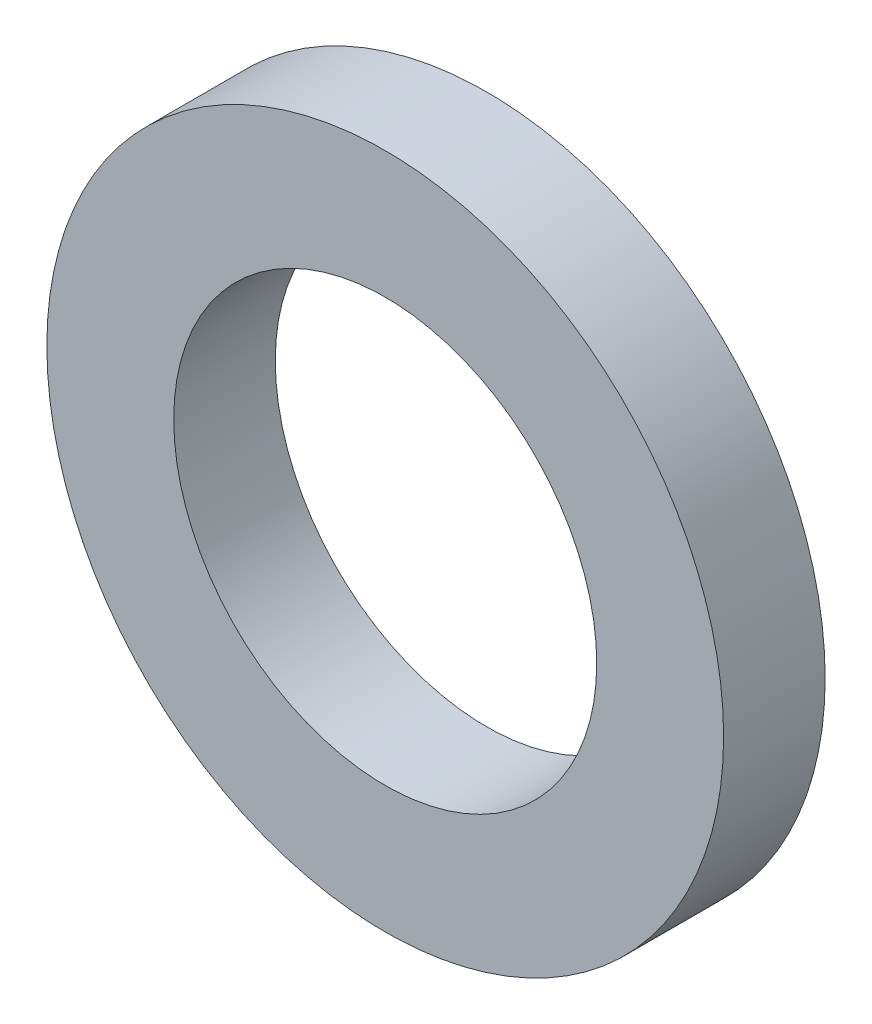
from build123d import *

# Parameters (mm, degrees)
ESQUISSE1_R        = 4
ESQUISSE1_R_2      = 2.5
BOSS_EXTRU_1_DEPTH = 1.2


with BuildPart() as part:
    # Esquisse1 → Boss.-Extru.1 (new body)
    with BuildSketch(Plane.XY):
        Circle(ESQUISSE1_R)
        Circle(ESQUISSE1_R_2, mode=Mode.SUBTRACT)
    extrude(amount=BOSS_EXTRU_1_DEPTH)


solid = part.part
